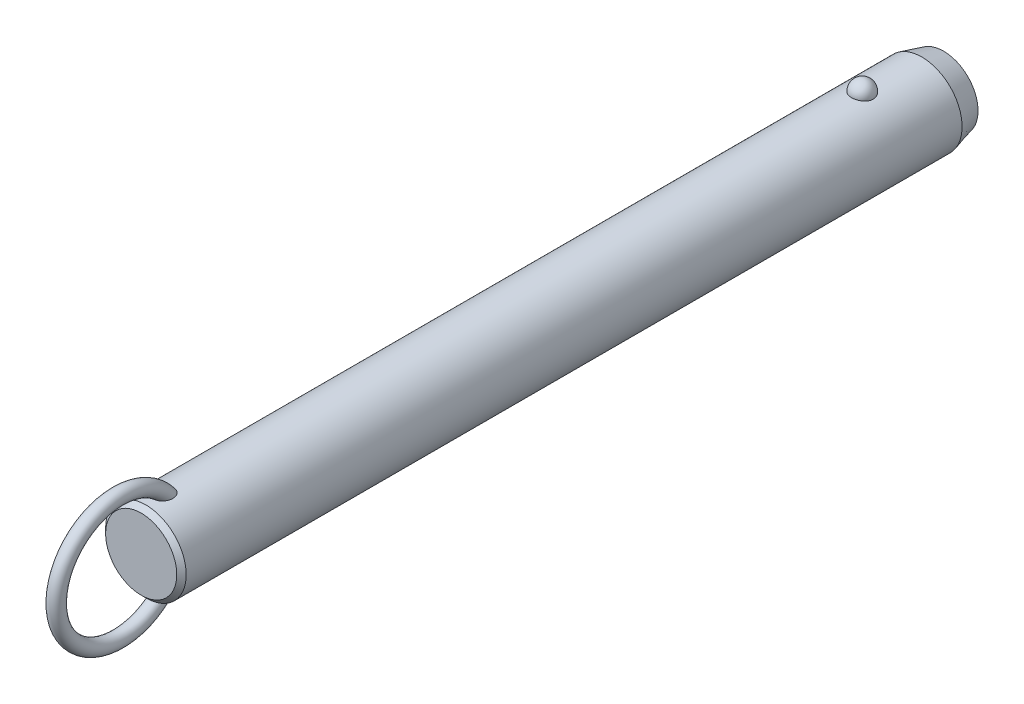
ISO-10303-21;
HEADER;
FILE_DESCRIPTION(('STEP AP214'),'2;1');
FILE_NAME('part.step','',(''),(''),'','','');
FILE_SCHEMA(('AUTOMOTIVE_DESIGN { 1 0 10303 214 1 1 1 1 }'));
ENDSEC;
DATA;
#1=APPLICATION_CONTEXT('core data for automotive mechanical design processes');
#2=APPLICATION_PROTOCOL_DEFINITION('international standard','automotive_design',2000,#1);
#3=PRODUCT_CONTEXT('',#1,'mechanical');
#4=PRODUCT('Part','Part','',(#3));
#5=PRODUCT_RELATED_PRODUCT_CATEGORY('part','',(#4));
#6=PRODUCT_DEFINITION_FORMATION('','',#4);
#7=PRODUCT_DEFINITION_CONTEXT('part definition',#1,'design');
#8=PRODUCT_DEFINITION('design','',#6,#7);
#9=PRODUCT_DEFINITION_SHAPE('','',#8);
#10=(LENGTH_UNIT() NAMED_UNIT(*) SI_UNIT(.MILLI.,.METRE.));
#11=(NAMED_UNIT(*) PLANE_ANGLE_UNIT() SI_UNIT($,.RADIAN.));
#12=(NAMED_UNIT(*) SI_UNIT($,.STERADIAN.) SOLID_ANGLE_UNIT());
#13=UNCERTAINTY_MEASURE_WITH_UNIT(LENGTH_MEASURE(1.E-05),#10,'distance_accuracy_value','');
#14=(GEOMETRIC_REPRESENTATION_CONTEXT(3) GLOBAL_UNCERTAINTY_ASSIGNED_CONTEXT((#13)) GLOBAL_UNIT_ASSIGNED_CONTEXT((#10,
#11,#12)) REPRESENTATION_CONTEXT('',''));
#15=CARTESIAN_POINT('',(0.,0.,0.));
#16=DIRECTION('',(0.,0.,1.));
#17=DIRECTION('',(1.,0.,0.));
#18=AXIS2_PLACEMENT_3D('',#15,#16,#17);
#19=CARTESIAN_POINT('',(0.,0.,182.9));
#20=DIRECTION('',(0.,0.,-1.));
#21=DIRECTION('',(-1.,0.,0.));
#22=AXIS2_PLACEMENT_3D('',#19,#20,#21);
#23=CYLINDRICAL_SURFACE('',#22,11.1);
#24=CARTESIAN_POINT('',(2.9724815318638,10.6945945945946,-3.00000000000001));
#25=CARTESIAN_POINT('',(2.97247830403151,10.6945972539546,-2.8322505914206));
#26=CARTESIAN_POINT('',(2.95876598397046,10.6984356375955,-2.66445972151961));
#27=CARTESIAN_POINT('',(2.90424529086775,10.7133624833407,-2.3336238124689));
#28=CARTESIAN_POINT('',(2.8634252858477,10.7244540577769,-2.17058084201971));
#29=CARTESIAN_POINT('',(2.75573657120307,10.7526272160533,-1.85396767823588));
#30=CARTESIAN_POINT('',(2.68887937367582,10.7697061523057,-1.70039333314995));
#31=CARTESIAN_POINT('',(2.53079696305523,10.8079438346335,-1.4069159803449));
#32=CARTESIAN_POINT('',(2.43957264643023,10.8291024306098,-1.26701246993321));
#33=CARTESIAN_POINT('',(2.23458150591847,10.8732541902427,-1.00409565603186));
#34=CARTESIAN_POINT('',(2.12071295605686,10.8962553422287,-0.881162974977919));
#35=CARTESIAN_POINT('',(1.87365402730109,10.9414421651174,-0.656352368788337));
#36=CARTESIAN_POINT('',(1.74046358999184,10.9636278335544,-0.554474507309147));
#37=CARTESIAN_POINT('',(1.45872188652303,11.0046495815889,-0.374872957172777));
#38=CARTESIAN_POINT('',(1.31021276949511,11.0234944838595,-0.297085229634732));
#39=CARTESIAN_POINT('',(1.00170030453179,11.0557957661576,-0.167529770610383));
#40=CARTESIAN_POINT('',(0.841698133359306,11.0692526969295,-0.1157593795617));
#41=CARTESIAN_POINT('',(0.517607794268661,11.0890932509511,-0.0403925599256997));
#42=CARTESIAN_POINT('',(0.353633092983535,11.0955916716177,-0.0163383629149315));
#43=CARTESIAN_POINT('',(0.0238420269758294,11.1011989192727,0.00445177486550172));
#44=CARTESIAN_POINT('',(-0.141974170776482,11.1003084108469,0.00119017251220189));
#45=CARTESIAN_POINT('',(-0.468405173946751,11.0912990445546,-0.0323233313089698));
#46=CARTESIAN_POINT('',(-0.629059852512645,11.0832767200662,-0.062214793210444));
#47=CARTESIAN_POINT('',(-0.942937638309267,11.0609962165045,-0.147645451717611));
#48=CARTESIAN_POINT('',(-1.09616062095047,11.0467379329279,-0.203185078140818));
#49=CARTESIAN_POINT('',(-1.39181061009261,11.0134071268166,-0.338752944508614));
#50=CARTESIAN_POINT('',(-1.53417383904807,10.9943086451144,-0.418913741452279));
#51=CARTESIAN_POINT('',(-1.80342160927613,10.9533667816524,-0.601448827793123));
#52=CARTESIAN_POINT('',(-1.9303046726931,10.9315231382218,-0.703825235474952));
#53=CARTESIAN_POINT('',(-2.16747598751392,10.887005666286,-0.930091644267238));
#54=CARTESIAN_POINT('',(-2.27742774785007,10.8643239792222,-1.05433291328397));
#55=CARTESIAN_POINT('',(-2.47517316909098,10.8209886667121,-1.31966633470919));
#56=CARTESIAN_POINT('',(-2.56296538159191,10.8003351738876,-1.46075958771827));
#57=CARTESIAN_POINT('',(-2.71500300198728,10.7631304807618,-1.75753646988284));
#58=CARTESIAN_POINT('',(-2.77898901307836,10.7466250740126,-1.91335887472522));
#59=CARTESIAN_POINT('',(-2.88046189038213,10.7198747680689,-2.23391529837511));
#60=CARTESIAN_POINT('',(-2.91794947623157,10.709629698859,-2.3986490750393));
#61=CARTESIAN_POINT('',(-2.96537819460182,10.6965949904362,-2.73165170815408));
#62=CARTESIAN_POINT('',(-2.97542891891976,10.693775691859,-2.89990378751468));
#63=CARTESIAN_POINT('',(-2.96804271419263,10.6958279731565,-3.23575286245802));
#64=CARTESIAN_POINT('',(-2.95060646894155,10.7006993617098,-3.4033498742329));
#65=CARTESIAN_POINT('',(-2.88883358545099,10.71753912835,-3.73233906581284));
#66=CARTESIAN_POINT('',(-2.84462026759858,10.7294749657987,-3.89375610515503));
#67=CARTESIAN_POINT('',(-2.73050447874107,10.7590797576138,-4.20667949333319));
#68=CARTESIAN_POINT('',(-2.66060103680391,10.7767489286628,-4.35818546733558));
#69=CARTESIAN_POINT('',(-2.49642559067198,10.8159599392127,-4.64785421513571));
#70=CARTESIAN_POINT('',(-2.40203047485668,10.8375211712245,-4.78594458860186));
#71=CARTESIAN_POINT('',(-2.19143488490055,10.8820570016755,-5.04410382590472));
#72=CARTESIAN_POINT('',(-2.07523364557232,10.9050316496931,-5.16417205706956));
#73=CARTESIAN_POINT('',(-1.82361254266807,10.9499219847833,-5.3833483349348));
#74=CARTESIAN_POINT('',(-1.68812945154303,10.9718338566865,-5.48238464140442));
#75=CARTESIAN_POINT('',(-1.40191298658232,11.0120611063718,-5.65618873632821));
#76=CARTESIAN_POINT('',(-1.25118062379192,11.0303767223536,-5.73095813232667));
#77=CARTESIAN_POINT('',(-0.940570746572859,11.0611653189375,-5.85334725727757));
#78=CARTESIAN_POINT('',(-0.780821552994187,11.0737044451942,-5.90127578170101));
#79=CARTESIAN_POINT('',(-0.455204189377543,11.0918598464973,-5.96992976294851));
#80=CARTESIAN_POINT('',(-0.289336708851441,11.0974768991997,-5.99065827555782));
#81=CARTESIAN_POINT('',(0.0406846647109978,11.1011307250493,-6.00418773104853));
#82=CARTESIAN_POINT('',(0.204817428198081,11.099299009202,-5.9974731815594));
#83=CARTESIAN_POINT('',(0.5295530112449,11.088551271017,-5.95740317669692));
#84=CARTESIAN_POINT('',(0.69015594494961,11.0796354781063,-5.92404858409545));
#85=CARTESIAN_POINT('',(1.0027760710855,11.0557204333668,-5.83180084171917));
#86=CARTESIAN_POINT('',(1.15482001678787,11.0407414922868,-5.7729929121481));
#87=CARTESIAN_POINT('',(1.44678373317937,11.0062913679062,-5.63147366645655));
#88=CARTESIAN_POINT('',(1.58670279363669,10.9868199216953,-5.54876095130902));
#89=CARTESIAN_POINT('',(1.8527023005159,10.9451315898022,-5.36027644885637));
#90=CARTESIAN_POINT('',(1.97855158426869,10.9228788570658,-5.25418644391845));
#91=CARTESIAN_POINT('',(2.21080872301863,10.8782509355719,-5.02251354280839));
#92=CARTESIAN_POINT('',(2.31721312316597,10.8558757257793,-4.89692718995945));
#93=CARTESIAN_POINT('',(2.5094551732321,10.8130715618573,-4.62745408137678));
#94=CARTESIAN_POINT('',(2.59493284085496,10.7926798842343,-4.48330448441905));
#95=CARTESIAN_POINT('',(2.740862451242,10.7565495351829,-4.18236358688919));
#96=CARTESIAN_POINT('',(2.80132490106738,10.7408089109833,-4.02557762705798));
#97=CARTESIAN_POINT('',(2.88959070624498,10.7173718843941,-3.72475308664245));
#98=CARTESIAN_POINT('',(2.92062102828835,10.7088950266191,-3.58171216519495));
#99=CARTESIAN_POINT('',(2.96206765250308,10.6975052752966,-3.29245795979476));
#100=CARTESIAN_POINT('',(2.97248434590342,10.6945922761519,-3.14624473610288));
#101=CARTESIAN_POINT('',(2.9724815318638,10.6945945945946,-3.00000000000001));
#102=B_SPLINE_CURVE_WITH_KNOTS('',3,(#24,#25,#26,#27,#28,#29,#30,#31,#32,#33,#34,#35,#36,#37,
#38,#39,#40,#41,#42,#43,#44,#45,#46,#47,#48,#49,#50,#51,#52,#53,#54,#55,#56,#57,#58,#59,#60,#61,
#62,#63,#64,#65,#66,#67,#68,#69,#70,#71,#72,#73,#74,#75,#76,#77,#78,#79,#80,#81,#82,#83,#84,#85,
#86,#87,#88,#89,#90,#91,#92,#93,#94,#95,#96,#97,#98,#99,#100,#101),.UNSPECIFIED.,.T.,.F.,(4,2,2,
2,2,2,2,2,2,2,2,2,2,2,2,2,2,2,2,2,2,2,2,2,2,2,2,2,2,2,2,2,2,2,2,2,2,2,4),(0.,0.502722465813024,
1.00566079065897,1.5083769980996,2.01107471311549,2.51608392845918,3.02109467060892,
3.52475118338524,4.02835620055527,4.523518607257,5.0186364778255,5.50715297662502,
5.9956776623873,6.48688002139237,6.97812923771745,7.47814366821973,7.9781907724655,
8.48353712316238,8.9888697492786,9.49218093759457,9.99547960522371,10.4964777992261,
10.997494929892,11.5010810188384,12.0046847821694,12.5099796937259,13.0152411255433,
13.5145635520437,14.0138298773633,14.5043200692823,14.9947943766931,15.4836390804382,
15.9725123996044,16.4685040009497,16.9645836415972,17.4686765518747,17.972557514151,
18.410841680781,18.849117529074),.UNSPECIFIED.);
#103=CARTESIAN_POINT('',(2.9724815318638,10.6945945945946,-3.00000000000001));
#104=VERTEX_POINT('',#103);
#105=EDGE_CURVE('E41',#104,#104,#102,.T.);
#106=ORIENTED_EDGE('',*,*,#105,.T.);
#107=EDGE_LOOP('',(#106));
#108=FACE_BOUND('',#107,.T.);
#109=CARTESIAN_POINT('',(0.,0.,194.3));
#110=DIRECTION('',(0.,0.,1.));
#111=DIRECTION('',(1.,0.,0.));
#112=AXIS2_PLACEMENT_3D('',#109,#110,#111);
#113=CIRCLE('',#112,11.1);
#114=CARTESIAN_POINT('',(-11.1,0.,194.3));
#115=VERTEX_POINT('',#114);
#116=EDGE_CURVE('E10',#115,#115,#113,.F.);
#117=ORIENTED_EDGE('',*,*,#116,.T.);
#118=EDGE_LOOP('',(#117));
#119=FACE_BOUND('',#118,.T.);
#120=CARTESIAN_POINT('',(-0.564520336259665,-11.0856356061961,186.557815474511));
#121=CARTESIAN_POINT('',(-0.667202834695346,-11.0804062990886,186.591283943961));
#122=CARTESIAN_POINT('',(-0.766875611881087,-11.0738877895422,186.633835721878));
#123=CARTESIAN_POINT('',(-0.95728412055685,-11.0590576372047,186.735419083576));
#124=CARTESIAN_POINT('',(-1.04801616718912,-11.0507452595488,186.79445742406));
#125=CARTESIAN_POINT('',(-1.21800952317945,-11.0333016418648,186.926529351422));
#126=CARTESIAN_POINT('',(-1.2973080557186,-11.0241732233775,186.999515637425));
#127=CARTESIAN_POINT('',(-1.44337665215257,-11.0060026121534,187.157037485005));
#128=CARTESIAN_POINT('',(-1.51014622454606,-10.9969604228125,187.241573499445));
#129=CARTESIAN_POINT('',(-1.63454620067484,-10.9791841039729,187.425521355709));
#130=CARTESIAN_POINT('',(-1.69127003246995,-10.9705107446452,187.525549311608));
#131=CARTESIAN_POINT('',(-1.7898078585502,-10.9548648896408,187.732790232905));
#132=CARTESIAN_POINT('',(-1.83161214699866,-10.9478935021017,187.840007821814));
#133=CARTESIAN_POINT('',(-1.91557028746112,-10.9335803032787,188.105408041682));
#134=CARTESIAN_POINT('',(-1.95040620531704,-10.9273269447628,188.265980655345));
#135=CARTESIAN_POINT('',(-1.99388326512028,-10.9194709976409,188.590697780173));
#136=CARTESIAN_POINT('',(-2.00248051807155,-10.9178762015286,188.754847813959));
#137=CARTESIAN_POINT('',(-1.99551615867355,-10.9191578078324,189.124650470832));
#138=CARTESIAN_POINT('',(-1.9732206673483,-10.9232807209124,189.330191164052));
#139=CARTESIAN_POINT('',(-1.9152976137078,-10.9335244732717,189.633595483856));
#140=CARTESIAN_POINT('',(-1.89184575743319,-10.9376266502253,189.734088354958));
#141=CARTESIAN_POINT('',(-1.83700674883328,-10.9469720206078,189.932855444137));
#142=CARTESIAN_POINT('',(-1.80562070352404,-10.9522150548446,190.031129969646));
#143=CARTESIAN_POINT('',(-1.73463055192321,-10.9636837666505,190.225914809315));
#144=CARTESIAN_POINT('',(-1.69493416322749,-10.9699202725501,190.322390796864));
#145=CARTESIAN_POINT('',(-1.60745141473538,-10.9830806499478,190.511626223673));
#146=CARTESIAN_POINT('',(-1.55966150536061,-10.9900048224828,190.604384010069));
#147=CARTESIAN_POINT('',(-1.45591812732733,-11.0042280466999,190.784690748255));
#148=CARTESIAN_POINT('',(-1.40000013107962,-11.0115253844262,190.872260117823));
#149=CARTESIAN_POINT('',(-1.27937470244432,-11.0261911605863,191.041029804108));
#150=CARTESIAN_POINT('',(-1.21467835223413,-11.0335594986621,191.12223795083));
#151=CARTESIAN_POINT('',(-1.08218150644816,-11.0473027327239,191.269001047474));
#152=CARTESIAN_POINT('',(-1.01522633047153,-11.0537063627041,191.335309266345));
#153=CARTESIAN_POINT('',(-0.872952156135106,-11.065850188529,191.458378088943));
#154=CARTESIAN_POINT('',(-0.797642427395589,-11.0715911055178,191.515149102));
#155=CARTESIAN_POINT('',(-0.651396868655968,-11.081071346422,191.607515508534));
#156=CARTESIAN_POINT('',(-0.581712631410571,-11.0849841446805,191.645049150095));
#157=CARTESIAN_POINT('',(-0.43706608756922,-11.0916271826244,191.708259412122));
#158=CARTESIAN_POINT('',(-0.362109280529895,-11.0943586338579,191.733948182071));
#159=CARTESIAN_POINT('',(-0.207828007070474,-11.0983242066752,191.771117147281));
#160=CARTESIAN_POINT('',(-0.12846771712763,-11.0995432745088,191.782454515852));
#161=CARTESIAN_POINT('',(0.0309101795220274,-11.1002423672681,191.788965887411));
#162=CARTESIAN_POINT('',(0.110927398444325,-11.0997233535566,191.784148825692));
#163=CARTESIAN_POINT('',(0.25640659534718,-11.097240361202,191.760959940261));
#164=CARTESIAN_POINT('',(0.322235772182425,-11.0955074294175,191.744754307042));
#165=CARTESIAN_POINT('',(0.450635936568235,-11.0910350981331,191.702600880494));
#166=CARTESIAN_POINT('',(0.513205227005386,-11.0882951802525,191.676648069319));
#167=CARTESIAN_POINT('',(0.662626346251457,-11.0805620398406,191.602607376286));
#168=CARTESIAN_POINT('',(0.747127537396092,-11.0751144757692,191.549845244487));
#169=CARTESIAN_POINT('',(0.906756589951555,-11.0631932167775,191.431720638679));
#170=CARTESIAN_POINT('',(0.981859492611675,-11.0567168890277,191.366325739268));
#171=CARTESIAN_POINT('',(1.10712207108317,-11.0447856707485,191.24226337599));
#172=CARTESIAN_POINT('',(1.15909566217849,-11.0394280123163,191.185383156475));
#173=CARTESIAN_POINT('',(1.2579192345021,-11.0286040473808,191.067327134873));
#174=CARTESIAN_POINT('',(1.30476642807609,-11.0231376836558,191.006149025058));
#175=CARTESIAN_POINT('',(1.43818612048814,-11.0068027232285,190.817305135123));
#176=CARTESIAN_POINT('',(1.51751767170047,-10.9960104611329,190.684453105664));
#177=CARTESIAN_POINT('',(1.63597546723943,-10.9788847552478,190.453137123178));
#178=CARTESIAN_POINT('',(1.67988876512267,-10.9722190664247,190.357053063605));
#179=CARTESIAN_POINT('',(1.75953241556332,-10.9597298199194,190.161431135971));
#180=CARTESIAN_POINT('',(1.7952596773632,-10.9539065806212,190.061891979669));
#181=CARTESIAN_POINT('',(1.85844731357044,-10.9433632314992,189.86021118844));
#182=CARTESIAN_POINT('',(1.88591073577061,-10.9386427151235,189.75807052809));
#183=CARTESIAN_POINT('',(1.93234324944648,-10.9305350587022,189.551819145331));
#184=CARTESIAN_POINT('',(1.95131065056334,-10.9271481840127,189.447708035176));
#185=CARTESIAN_POINT('',(1.9904020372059,-10.9201183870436,189.165458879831));
#186=CARTESIAN_POINT('',(2.00221217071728,-10.9179256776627,188.986037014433));
#187=CARTESIAN_POINT('',(1.99711676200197,-10.9188636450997,188.627713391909));
#188=CARTESIAN_POINT('',(1.98026150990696,-10.9219849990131,188.448811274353));
#189=CARTESIAN_POINT('',(1.92151657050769,-10.9324473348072,188.13645144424));
#190=CARTESIAN_POINT('',(1.88605081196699,-10.9386915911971,188.001759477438));
#191=CARTESIAN_POINT('',(1.79393020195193,-10.9541780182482,187.739966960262));
#192=CARTESIAN_POINT('',(1.73729868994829,-10.9634168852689,187.612858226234));
#193=CARTESIAN_POINT('',(1.61237037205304,-10.9824218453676,187.389418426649));
#194=CARTESIAN_POINT('',(1.54715374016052,-10.9918945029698,187.291345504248));
#195=CARTESIAN_POINT('',(1.40127026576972,-11.0114415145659,187.107434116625));
#196=CARTESIAN_POINT('',(1.32060742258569,-11.0215157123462,187.021592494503));
#197=CARTESIAN_POINT('',(1.1447478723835,-11.041168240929,186.865163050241));
#198=CARTESIAN_POINT('',(1.04947805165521,-11.0507437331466,186.794656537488));
#199=CARTESIAN_POINT('',(0.847278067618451,-11.0680789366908,186.672640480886));
#200=CARTESIAN_POINT('',(0.74035174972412,-11.0758392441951,186.621124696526));
#201=CARTESIAN_POINT('',(0.529289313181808,-11.0878275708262,186.543485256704));
#202=CARTESIAN_POINT('',(0.425895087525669,-11.0923259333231,186.515377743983));
#203=CARTESIAN_POINT('',(0.215723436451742,-11.0984001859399,186.477703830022));
#204=CARTESIAN_POINT('',(0.108947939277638,-11.0999777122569,186.468127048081));
#205=CARTESIAN_POINT('',(-0.0938962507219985,-11.1000196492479,186.467877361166));
#206=CARTESIAN_POINT('',(-0.189967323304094,-11.0987797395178,186.475408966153));
#207=CARTESIAN_POINT('',(-0.379657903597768,-11.0939111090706,186.505507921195));
#208=CARTESIAN_POINT('',(-0.47327735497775,-11.0902823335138,186.528075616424));
#209=CARTESIAN_POINT('',(-0.564520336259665,-11.0856356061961,186.557815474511));
#210=B_SPLINE_CURVE_WITH_KNOTS('',3,(#120,#121,#122,#123,#124,#125,#126,#127,#128,#129,#130,
#131,#132,#133,#134,#135,#136,#137,#138,#139,#140,#141,#142,#143,#144,#145,#146,#147,#148,#149,
#150,#151,#152,#153,#154,#155,#156,#157,#158,#159,#160,#161,#162,#163,#164,#165,#166,#167,#168,
#169,#170,#171,#172,#173,#174,#175,#176,#177,#178,#179,#180,#181,#182,#183,#184,#185,#186,#187,
#188,#189,#190,#191,#192,#193,#194,#195,#196,#197,#198,#199,#200,#201,#202,#203,#204,#205,#206,
#207,#208,#209),.UNSPECIFIED.,.T.,.F.,(4,2,2,2,2,2,2,2,2,2,2,2,2,2,2,2,2,2,2,2,2,2,2,2,2,2,2,2,
2,2,2,2,2,2,2,2,2,2,2,2,2,2,2,2,4),(0.,0.323999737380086,0.64813245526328,0.971184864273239,
1.29424994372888,1.63886237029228,1.98369857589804,2.47426059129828,2.96564271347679,
3.58257396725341,3.89215258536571,4.20168803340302,4.51486273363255,4.82817514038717,
5.14015911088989,5.45175282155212,5.73442856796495,6.01679375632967,6.2536458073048,
6.49025437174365,6.72919963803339,6.96801276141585,7.17061258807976,7.37331685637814,
7.67094989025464,7.96935728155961,8.20075067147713,8.43226927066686,8.89581623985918,
9.21306533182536,9.53043400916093,9.84768549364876,10.1650000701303,10.7022930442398,
11.2386443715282,11.655339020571,12.071575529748,12.4245637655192,12.7774607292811,
13.1321855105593,13.4867936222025,13.8068771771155,14.1267813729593,14.4146787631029,
14.7025827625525),.UNSPECIFIED.);
#211=CARTESIAN_POINT('',(-0.564520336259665,-11.0856356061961,186.557815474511));
#212=VERTEX_POINT('',#211);
#213=EDGE_CURVE('E60',#212,#212,#210,.T.);
#214=ORIENTED_EDGE('',*,*,#213,.T.);
#215=EDGE_LOOP('',(#214));
#216=FACE_BOUND('',#215,.T.);
#217=CARTESIAN_POINT('',(-0.564520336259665,11.0856356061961,186.557815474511));
#218=CARTESIAN_POINT('',(-0.468542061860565,11.0905203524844,186.526545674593));
#219=CARTESIAN_POINT('',(-0.369793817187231,11.0942886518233,186.503157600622));
#220=CARTESIAN_POINT('',(-0.169555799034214,11.0991586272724,186.473085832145));
#221=CARTESIAN_POINT('',(-0.0680604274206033,11.1002543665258,186.46643932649));
#222=CARTESIAN_POINT('',(0.134549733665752,11.099646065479,186.470157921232));
#223=CARTESIAN_POINT('',(0.235664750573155,11.0979441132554,186.48051033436));
#224=CARTESIAN_POINT('',(0.434632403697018,11.0919342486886,186.517831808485));
#225=CARTESIAN_POINT('',(0.532486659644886,11.0876276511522,186.544792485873));
#226=CARTESIAN_POINT('',(0.722445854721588,11.0768742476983,186.6144096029));
#227=CARTESIAN_POINT('',(0.814543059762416,11.0704246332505,186.657086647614));
#228=CARTESIAN_POINT('',(0.990565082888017,11.0560659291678,186.756648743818));
#229=CARTESIAN_POINT('',(1.07448844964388,11.048156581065,186.813536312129));
#230=CARTESIAN_POINT('',(1.23562672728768,11.0313221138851,186.942210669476));
#231=CARTESIAN_POINT('',(1.31242684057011,11.0223686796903,187.014511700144));
#232=CARTESIAN_POINT('',(1.45398030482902,11.0045918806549,187.170042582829));
#233=CARTESIAN_POINT('',(1.51873073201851,10.9957685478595,187.253275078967));
#234=CARTESIAN_POINT('',(1.64107232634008,10.9782087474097,187.436384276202));
#235=CARTESIAN_POINT('',(1.6974317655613,10.9695572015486,187.537089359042));
#236=CARTESIAN_POINT('',(1.79515063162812,10.9539887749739,187.745626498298));
#237=CARTESIAN_POINT('',(1.83649966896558,10.9470730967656,187.85346343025));
#238=CARTESIAN_POINT('',(1.91931148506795,10.9329211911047,188.120399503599));
#239=CARTESIAN_POINT('',(1.95340104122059,10.9267904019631,188.281861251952));
#240=CARTESIAN_POINT('',(1.99526195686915,10.9192174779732,188.60821631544));
#241=CARTESIAN_POINT('',(2.00298989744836,10.9177830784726,188.77311484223));
#242=CARTESIAN_POINT('',(1.99396251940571,10.9194420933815,189.144100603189));
#243=CARTESIAN_POINT('',(1.97050829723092,10.923774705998,189.35003871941));
#244=CARTESIAN_POINT('',(1.91079643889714,10.9343131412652,189.653901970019));
#245=CARTESIAN_POINT('',(1.88673702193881,10.9385106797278,189.754529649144));
#246=CARTESIAN_POINT('',(1.83065508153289,10.9480376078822,189.953510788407));
#247=CARTESIAN_POINT('',(1.79863369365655,10.9533668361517,190.051864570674));
#248=CARTESIAN_POINT('',(1.72633365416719,10.9649954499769,190.246720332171));
#249=CARTESIAN_POINT('',(1.68596409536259,10.9713053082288,190.34318790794));
#250=CARTESIAN_POINT('',(1.59707998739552,10.9845964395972,190.532323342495));
#251=CARTESIAN_POINT('',(1.54856169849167,10.9915780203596,190.624989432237));
#252=CARTESIAN_POINT('',(1.44330168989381,11.0058935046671,190.804975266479));
#253=CARTESIAN_POINT('',(1.3865974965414,11.0132257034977,190.892316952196));
#254=CARTESIAN_POINT('',(1.26431158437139,11.0279330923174,191.060456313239));
#255=CARTESIAN_POINT('',(1.19874160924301,11.0353082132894,191.141262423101));
#256=CARTESIAN_POINT('',(1.06542088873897,11.048931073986,191.285985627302));
#257=CARTESIAN_POINT('',(0.998640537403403,11.0552153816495,191.350784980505));
#258=CARTESIAN_POINT('',(0.856896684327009,11.0671032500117,191.470846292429));
#259=CARTESIAN_POINT('',(0.781942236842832,11.0727075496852,191.526118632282));
#260=CARTESIAN_POINT('',(0.636276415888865,11.081949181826,191.615972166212));
#261=CARTESIAN_POINT('',(0.566755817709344,11.0857572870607,191.652441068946));
#262=CARTESIAN_POINT('',(0.422602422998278,11.0921860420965,191.713533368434));
#263=CARTESIAN_POINT('',(0.347974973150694,11.0948079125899,191.738168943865));
#264=CARTESIAN_POINT('',(0.194593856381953,11.0985608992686,191.773323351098));
#265=CARTESIAN_POINT('',(0.115807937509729,11.0996777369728,191.783706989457));
#266=CARTESIAN_POINT('',(-0.0422499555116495,11.1002003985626,191.788574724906));
#267=CARTESIAN_POINT('',(-0.121521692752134,11.09960699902,191.783066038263));
#268=CARTESIAN_POINT('',(-0.26604624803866,11.0970123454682,191.758827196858));
#269=CARTESIAN_POINT('',(-0.331661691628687,11.0952283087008,191.742135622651));
#270=CARTESIAN_POINT('',(-0.459588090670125,11.0906663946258,191.699111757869));
#271=CARTESIAN_POINT('',(-0.521897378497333,11.0878880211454,191.672774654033));
#272=CARTESIAN_POINT('',(-0.671446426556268,11.0800342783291,191.597513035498));
#273=CARTESIAN_POINT('',(-0.756250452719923,11.0744969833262,191.543818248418));
#274=CARTESIAN_POINT('',(-0.916349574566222,11.0624045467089,191.423802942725));
#275=CARTESIAN_POINT('',(-0.991618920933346,11.0558467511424,191.357449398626));
#276=CARTESIAN_POINT('',(-1.11713140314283,11.0437783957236,191.231633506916));
#277=CARTESIAN_POINT('',(-1.16920539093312,11.0383619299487,191.173952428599));
#278=CARTESIAN_POINT('',(-1.26817476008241,11.02743010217,191.054280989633));
#279=CARTESIAN_POINT('',(-1.31506731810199,11.0219146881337,190.992288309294));
#280=CARTESIAN_POINT('',(-1.40399813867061,11.0109399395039,190.864784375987));
#281=CARTESIAN_POINT('',(-1.44602864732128,11.0054807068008,190.799267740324));
#282=CARTESIAN_POINT('',(-1.52538779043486,10.9947621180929,190.665422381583));
#283=CARTESIAN_POINT('',(-1.56271516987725,10.9895028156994,190.597092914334));
#284=CARTESIAN_POINT('',(-1.64537943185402,10.9774790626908,190.433210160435));
#285=CARTESIAN_POINT('',(-1.68879497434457,10.9708503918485,190.3366735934));
#286=CARTESIAN_POINT('',(-1.76740738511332,10.9584602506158,190.140236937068));
#287=CARTESIAN_POINT('',(-1.80260120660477,10.95269910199,190.04033561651));
#288=CARTESIAN_POINT('',(-1.86468657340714,10.9423003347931,189.837966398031));
#289=CARTESIAN_POINT('',(-1.8915816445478,10.9376622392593,189.735499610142));
#290=CARTESIAN_POINT('',(-1.93682458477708,10.9297405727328,189.528642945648));
#291=CARTESIAN_POINT('',(-1.95517082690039,10.9264572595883,189.424252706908));
#292=CARTESIAN_POINT('',(-1.99232562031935,10.9197647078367,189.14262876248));
#293=CARTESIAN_POINT('',(-2.00294603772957,10.9177914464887,188.964185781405));
#294=CARTESIAN_POINT('',(-1.99566675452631,10.9191290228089,188.607996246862));
#295=CARTESIAN_POINT('',(-1.97781651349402,10.9224306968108,188.43024902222));
#296=CARTESIAN_POINT('',(-1.91747214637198,10.9331592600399,188.119792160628));
#297=CARTESIAN_POINT('',(-1.88131022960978,10.9395108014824,187.985825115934));
#298=CARTESIAN_POINT('',(-1.78790380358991,10.9551659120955,187.72559757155));
#299=CARTESIAN_POINT('',(-1.73068309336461,10.9644661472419,187.599328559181));
#300=CARTESIAN_POINT('',(-1.60475573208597,10.9835398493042,187.37741565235));
#301=CARTESIAN_POINT('',(-1.53908879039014,10.9930297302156,187.280026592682));
#302=CARTESIAN_POINT('',(-1.39238608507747,11.0125708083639,187.097525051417));
#303=CARTESIAN_POINT('',(-1.31135150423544,11.0226219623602,187.012411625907));
#304=CARTESIAN_POINT('',(-1.14382035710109,11.0411991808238,186.86529943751));
#305=CARTESIAN_POINT('',(-1.0585850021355,11.0497792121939,186.80186930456));
#306=CARTESIAN_POINT('',(-0.878723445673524,11.0655285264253,186.690250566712));
#307=CARTESIAN_POINT('',(-0.784123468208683,11.0727015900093,186.642020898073));
#308=CARTESIAN_POINT('',(-0.646163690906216,11.0812501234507,186.586023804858));
#309=CARTESIAN_POINT('',(-0.605595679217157,11.0835451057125,186.571197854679));
#310=CARTESIAN_POINT('',(-0.564520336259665,11.0856356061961,186.557815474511));
#311=B_SPLINE_CURVE_WITH_KNOTS('',3,(#217,#218,#219,#220,#221,#222,#223,#224,#225,#226,#227,
#228,#229,#230,#231,#232,#233,#234,#235,#236,#237,#238,#239,#240,#241,#242,#243,#244,#245,#246,
#247,#248,#249,#250,#251,#252,#253,#254,#255,#256,#257,#258,#259,#260,#261,#262,#263,#264,#265,
#266,#267,#268,#269,#270,#271,#272,#273,#274,#275,#276,#277,#278,#279,#280,#281,#282,#283,#284,
#285,#286,#287,#288,#289,#290,#291,#292,#293,#294,#295,#296,#297,#298,#299,#300,#301,#302,#303,
#304,#305,#306,#307,#308,#309,#310),.UNSPECIFIED.,.T.,.F.,(4,2,2,2,2,2,2,2,2,2,2,2,2,2,2,2,2,2,
2,2,2,2,2,2,2,2,2,2,2,2,2,2,2,2,2,2,2,2,2,2,2,2,2,2,2,2,4),(0.,0.303061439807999,
0.606795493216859,0.910302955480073,1.21365733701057,1.51741085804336,1.82121821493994,
2.1374520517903,2.45376252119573,2.79958678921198,3.14564996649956,3.63832391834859,
4.13180893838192,4.75031912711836,5.06071926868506,5.37107516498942,5.6850077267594,
5.99908475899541,6.31176519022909,6.62403542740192,6.90315673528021,7.18197194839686,
7.41687778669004,7.65154134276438,7.88841587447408,8.12518286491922,8.32752842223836,
8.52997509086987,8.82986421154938,9.13054668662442,9.36393502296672,9.59744991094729,
9.83133221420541,10.0652767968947,10.383032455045,10.7009056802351,11.0186436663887,
11.3364420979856,11.8705925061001,12.4038159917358,12.8189662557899,13.2336487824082,
13.5857049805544,13.9377340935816,14.2561354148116,14.5736690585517,14.7033687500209),.UNSPECIFIED.);
#312=CARTESIAN_POINT('',(-0.564520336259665,11.0856356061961,186.557815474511));
#313=VERTEX_POINT('',#312);
#314=EDGE_CURVE('E68',#313,#313,#311,.T.);
#315=ORIENTED_EDGE('',*,*,#314,.T.);
#316=EDGE_LOOP('',(#315));
#317=FACE_BOUND('',#316,.T.);
#318=CARTESIAN_POINT('',(0.,0.,-19.3999999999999));
#319=DIRECTION('',(0.,0.,-1.));
#320=DIRECTION('',(-1.,0.,0.));
#321=AXIS2_PLACEMENT_3D('',#318,#319,#320);
#322=CIRCLE('',#321,11.1);
#323=CARTESIAN_POINT('',(-11.1,0.,-19.3999999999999));
#324=VERTEX_POINT('',#323);
#325=EDGE_CURVE('E57',#324,#324,#322,.F.);
#326=ORIENTED_EDGE('',*,*,#325,.T.);
#327=EDGE_LOOP('',(#326));
#328=FACE_BOUND('',#327,.T.);
#329=ADVANCED_FACE('F37',(#108,#119,#216,#317,#328),#23,.T.);
#330=CARTESIAN_POINT('',(0.,0.,-25.4));
#331=DIRECTION('',(0.,0.,-1.));
#332=DIRECTION('',(-1.,0.,0.));
#333=AXIS2_PLACEMENT_3D('',#330,#331,#332);
#334=PLANE('',#333);
#335=CARTESIAN_POINT('',(0.,0.,-25.4));
#336=DIRECTION('',(0.,0.,-1.));
#337=DIRECTION('',(-1.,0.,0.));
#338=AXIS2_PLACEMENT_3D('',#335,#336,#337);
#339=CIRCLE('',#338,9.49230484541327);
#340=CARTESIAN_POINT('',(-9.49230484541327,0.,-25.4));
#341=VERTEX_POINT('',#340);
#342=EDGE_CURVE('E67',#341,#341,#339,.T.);
#343=ORIENTED_EDGE('',*,*,#342,.T.);
#344=EDGE_LOOP('',(#343));
#345=FACE_BOUND('',#344,.T.);
#346=ADVANCED_FACE('F86',(#345),#334,.T.);
#347=CARTESIAN_POINT('',(0.,0.,-25.4));
#348=DIRECTION('',(0.,0.,1.));
#349=DIRECTION('',(1.,0.,0.));
#350=AXIS2_PLACEMENT_3D('',#347,#348,#349);
#351=CONICAL_SURFACE('',#350,9.49230484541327,0.261799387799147);
#352=ORIENTED_EDGE('',*,*,#325,.F.);
#353=EDGE_LOOP('',(#352));
#354=FACE_BOUND('',#353,.T.);
#355=ORIENTED_EDGE('',*,*,#342,.F.);
#356=EDGE_LOOP('',(#355));
#357=FACE_BOUND('',#356,.T.);
#358=ADVANCED_FACE('F84',(#354,#357),#351,.T.);
#359=CARTESIAN_POINT('',(0.,0.,195.6));
#360=DIRECTION('',(0.,0.,1.));
#361=DIRECTION('',(1.,0.,0.));
#362=AXIS2_PLACEMENT_3D('',#359,#360,#361);
#363=PLANE('',#362);
#364=CARTESIAN_POINT('',(0.,0.,195.6));
#365=DIRECTION('',(0.,0.,1.));
#366=DIRECTION('',(1.,0.,0.));
#367=AXIS2_PLACEMENT_3D('',#364,#365,#366);
#368=CIRCLE('',#367,9.8);
#369=CARTESIAN_POINT('',(-9.80000000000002,0.,195.6));
#370=VERTEX_POINT('',#369);
#371=EDGE_CURVE('E50',#370,#370,#368,.T.);
#372=ORIENTED_EDGE('',*,*,#371,.T.);
#373=EDGE_LOOP('',(#372));
#374=FACE_BOUND('',#373,.T.);
#375=ADVANCED_FACE('F78',(#374),#363,.T.);
#376=CARTESIAN_POINT('',(0.,0.,201.95));
#377=DIRECTION('',(1.,0.,0.));
#378=DIRECTION('',(0.,0.,-1.));
#379=AXIS2_PLACEMENT_3D('',#376,#377,#378);
#380=TOROIDAL_SURFACE('',#379,17.05,2.);
#381=ORIENTED_EDGE('',*,*,#314,.F.);
#382=EDGE_LOOP('',(#381));
#383=FACE_BOUND('',#382,.T.);
#384=ORIENTED_EDGE('',*,*,#213,.F.);
#385=EDGE_LOOP('',(#384));
#386=FACE_BOUND('',#385,.T.);
#387=ADVANCED_FACE('F74',(#383,#386),#380,.T.);
#388=CARTESIAN_POINT('',(0.,0.,195.6));
#389=DIRECTION('',(0.,0.,-1.));
#390=DIRECTION('',(-1.,0.,0.));
#391=AXIS2_PLACEMENT_3D('',#388,#389,#390);
#392=CONICAL_SURFACE('',#391,9.8,0.785398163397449);
#393=CARTESIAN_POINT('',(-11.1,0.,194.3));
#394=CARTESIAN_POINT('',(-11.0864583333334,0.,194.313541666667));
#395=CARTESIAN_POINT('',(-11.0729166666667,0.,194.327083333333));
#396=CARTESIAN_POINT('',(-11.0458333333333,0.,194.354166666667));
#397=CARTESIAN_POINT('',(-11.0322916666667,0.,194.367708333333));
#398=CARTESIAN_POINT('',(-11.0052083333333,0.,194.394791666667));
#399=CARTESIAN_POINT('',(-10.9916666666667,0.,194.408333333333));
#400=CARTESIAN_POINT('',(-10.9645833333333,0.,194.435416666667));
#401=CARTESIAN_POINT('',(-10.9510416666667,0.,194.448958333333));
#402=CARTESIAN_POINT('',(-10.9239583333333,0.,194.476041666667));
#403=CARTESIAN_POINT('',(-10.9104166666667,0.,194.489583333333));
#404=CARTESIAN_POINT('',(-10.8833333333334,0.,194.516666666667));
#405=CARTESIAN_POINT('',(-10.8697916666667,0.,194.530208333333));
#406=CARTESIAN_POINT('',(-10.8427083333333,0.,194.557291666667));
#407=CARTESIAN_POINT('',(-10.8291666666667,0.,194.570833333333));
#408=CARTESIAN_POINT('',(-10.8020833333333,0.,194.597916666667));
#409=CARTESIAN_POINT('',(-10.7885416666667,0.,194.611458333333));
#410=CARTESIAN_POINT('',(-10.7614583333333,0.,194.638541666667));
#411=CARTESIAN_POINT('',(-10.7479166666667,0.,194.652083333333));
#412=CARTESIAN_POINT('',(-10.7208333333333,0.,194.679166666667));
#413=CARTESIAN_POINT('',(-10.7072916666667,0.,194.692708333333));
#414=CARTESIAN_POINT('',(-10.6802083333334,0.,194.719791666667));
#415=CARTESIAN_POINT('',(-10.6666666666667,0.,194.733333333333));
#416=CARTESIAN_POINT('',(-10.6395833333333,0.,194.760416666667));
#417=CARTESIAN_POINT('',(-10.6260416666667,0.,194.773958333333));
#418=CARTESIAN_POINT('',(-10.5989583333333,0.,194.801041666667));
#419=CARTESIAN_POINT('',(-10.5854166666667,0.,194.814583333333));
#420=CARTESIAN_POINT('',(-10.5583333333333,0.,194.841666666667));
#421=CARTESIAN_POINT('',(-10.5447916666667,0.,194.855208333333));
#422=CARTESIAN_POINT('',(-10.5177083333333,0.,194.882291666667));
#423=CARTESIAN_POINT('',(-10.5041666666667,0.,194.895833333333));
#424=CARTESIAN_POINT('',(-10.4770833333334,0.,194.922916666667));
#425=CARTESIAN_POINT('',(-10.4635416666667,0.,194.936458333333));
#426=CARTESIAN_POINT('',(-10.4364583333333,0.,194.963541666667));
#427=CARTESIAN_POINT('',(-10.4229166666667,0.,194.977083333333));
#428=CARTESIAN_POINT('',(-10.3958333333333,0.,195.004166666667));
#429=CARTESIAN_POINT('',(-10.3822916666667,0.,195.017708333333));
#430=CARTESIAN_POINT('',(-10.3552083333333,0.,195.044791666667));
#431=CARTESIAN_POINT('',(-10.3416666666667,0.,195.058333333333));
#432=CARTESIAN_POINT('',(-10.3145833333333,0.,195.085416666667));
#433=CARTESIAN_POINT('',(-10.3010416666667,0.,195.098958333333));
#434=CARTESIAN_POINT('',(-10.2739583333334,0.,195.126041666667));
#435=CARTESIAN_POINT('',(-10.2604166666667,0.,195.139583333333));
#436=CARTESIAN_POINT('',(-10.2333333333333,0.,195.166666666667));
#437=CARTESIAN_POINT('',(-10.2197916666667,0.,195.180208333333));
#438=CARTESIAN_POINT('',(-10.1927083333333,0.,195.207291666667));
#439=CARTESIAN_POINT('',(-10.1791666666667,0.,195.220833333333));
#440=CARTESIAN_POINT('',(-10.1520833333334,0.,195.247916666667));
#441=CARTESIAN_POINT('',(-10.1385416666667,0.,195.261458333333));
#442=CARTESIAN_POINT('',(-10.1114583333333,0.,195.288541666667));
#443=CARTESIAN_POINT('',(-10.0979166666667,0.,195.302083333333));
#444=CARTESIAN_POINT('',(-10.0708333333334,0.,195.329166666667));
#445=CARTESIAN_POINT('',(-10.0572916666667,0.,195.342708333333));
#446=CARTESIAN_POINT('',(-10.0302083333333,0.,195.369791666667));
#447=CARTESIAN_POINT('',(-10.0166666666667,0.,195.383333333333));
#448=CARTESIAN_POINT('',(-9.98958333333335,0.,195.410416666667));
#449=CARTESIAN_POINT('',(-9.97604166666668,0.,195.423958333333));
#450=CARTESIAN_POINT('',(-9.94895833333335,0.,195.451041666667));
#451=CARTESIAN_POINT('',(-9.93541666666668,0.,195.464583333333));
#452=CARTESIAN_POINT('',(-9.90833333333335,0.,195.491666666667));
#453=CARTESIAN_POINT('',(-9.89479166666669,0.,195.505208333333));
#454=CARTESIAN_POINT('',(-9.86770833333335,0.,195.532291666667));
#455=CARTESIAN_POINT('',(-9.85416666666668,0.,195.545833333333));
#456=CARTESIAN_POINT('',(-9.82708333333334,0.,195.572916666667));
#457=CARTESIAN_POINT('',(-9.81354166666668,0.,195.586458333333));
#458=CARTESIAN_POINT('',(-9.80000000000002,0.,195.6));
#459=B_SPLINE_CURVE_WITH_KNOTS('',3,(#393,#394,#395,#396,#397,#398,#399,#400,#401,#402,#403,
#404,#405,#406,#407,#408,#409,#410,#411,#412,#413,#414,#415,#416,#417,#418,#419,#420,#421,#422,
#423,#424,#425,#426,#427,#428,#429,#430,#431,#432,#433,#434,#435,#436,#437,#438,#439,#440,#441,
#442,#443,#444,#445,#446,#447,#448,#449,#450,#451,#452,#453,#454,#455,#456,#457,#458),
.UNSPECIFIED.,.F.,.F.,(4,2,2,2,2,2,2,2,2,2,2,2,2,2,2,2,2,2,2,2,2,2,2,2,2,2,2,2,2,2,2,2,4),(0.,
0.0574524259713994,0.114904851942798,0.172357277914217,0.229809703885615,0.287262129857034,
0.344714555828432,0.402166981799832,0.459619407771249,0.517071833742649,0.574524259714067,
0.631976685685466,0.689429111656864,0.746881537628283,0.804333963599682,0.861786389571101,
0.9192388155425,0.976691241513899,1.03414366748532,1.09159609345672,1.14904851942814,
1.20650094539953,1.26395337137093,1.32140579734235,1.37885822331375,1.43631064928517,
1.49376307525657,1.55121550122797,1.60866792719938,1.66612035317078,1.7235727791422,
1.7810252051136,1.83847763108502),.UNSPECIFIED.);
#460=EDGE_CURVE('BSEAM39',#115,#370,#459,.T.);
#461=ORIENTED_EDGE('',*,*,#116,.F.);
#462=ORIENTED_EDGE('',*,*,#371,.F.);
#463=ORIENTED_EDGE('',*,*,#460,.T.);
#464=ORIENTED_EDGE('',*,*,#460,.F.);
#465=EDGE_LOOP('',(#461,#463,#462,#464));
#466=FACE_BOUND('',#465,.T.);
#467=ADVANCED_FACE('F39',(#466),#392,.T.);
#468=CARTESIAN_POINT('',(0.,11.1,-3.00000000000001));
#469=DIRECTION('',(0.,1.,0.));
#470=DIRECTION('',(0.,0.,-1.));
#471=AXIS2_PLACEMENT_3D('',#468,#469,#470);
#472=SPHERICAL_SURFACE('',#471,3.);
#473=ORIENTED_EDGE('',*,*,#105,.F.);
#474=EDGE_LOOP('',(#473));
#475=FACE_BOUND('',#474,.T.);
#476=ADVANCED_FACE('F80',(#475),#472,.T.);
#477=CLOSED_SHELL('',(#329,#346,#358,#375,#387,#467,#476));
#478=MANIFOLD_SOLID_BREP('B2',#477);
#479=ADVANCED_BREP_SHAPE_REPRESENTATION('',(#18,#478),#14);
#480=SHAPE_DEFINITION_REPRESENTATION(#9,#479);
ENDSEC;
END-ISO-10303-21;
